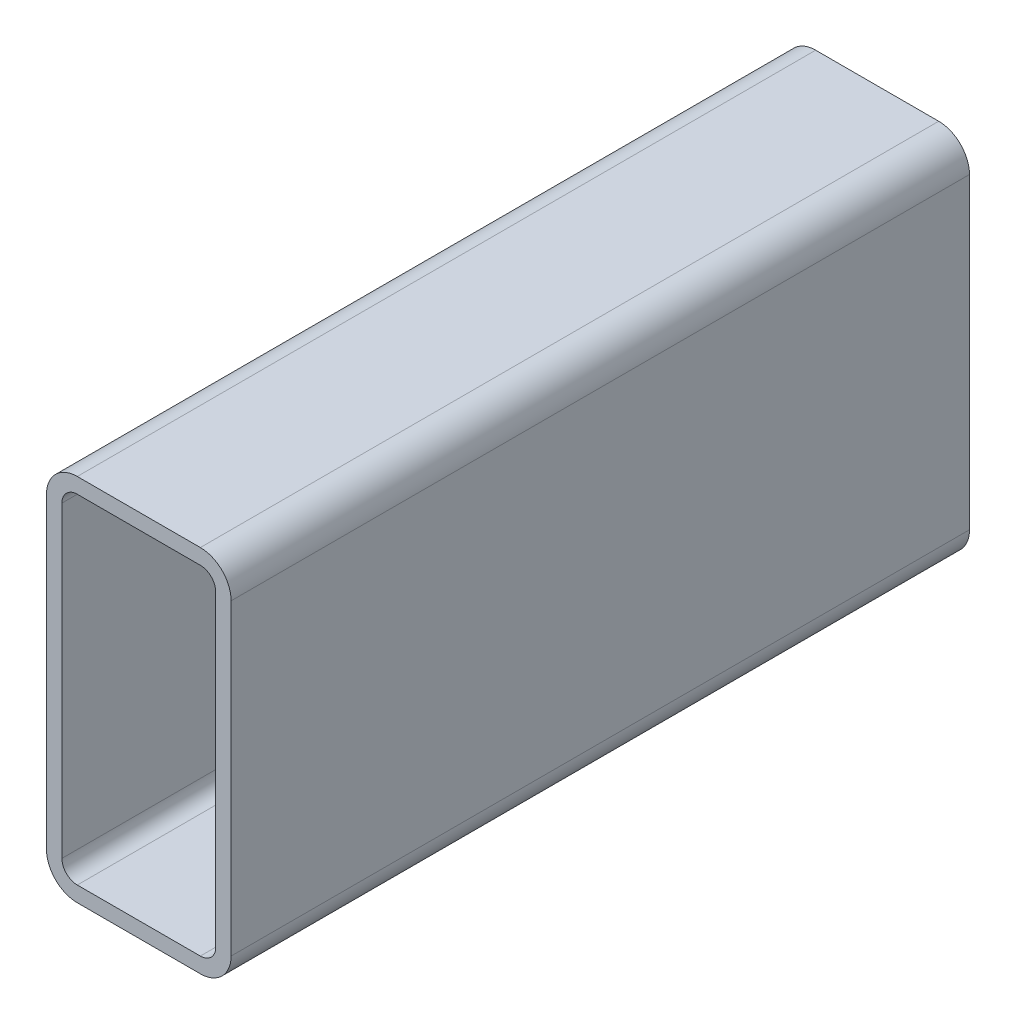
ISO-10303-21;
HEADER;
FILE_DESCRIPTION(('STEP AP214'),'2;1');
FILE_NAME('part.step','',(''),(''),'','','');
FILE_SCHEMA(('AUTOMOTIVE_DESIGN { 1 0 10303 214 1 1 1 1 }'));
ENDSEC;
DATA;
#1=APPLICATION_CONTEXT('core data for automotive mechanical design processes');
#2=APPLICATION_PROTOCOL_DEFINITION('international standard','automotive_design',2000,#1);
#3=PRODUCT_CONTEXT('',#1,'mechanical');
#4=PRODUCT('Part','Part','',(#3));
#5=PRODUCT_RELATED_PRODUCT_CATEGORY('part','',(#4));
#6=PRODUCT_DEFINITION_FORMATION('','',#4);
#7=PRODUCT_DEFINITION_CONTEXT('part definition',#1,'design');
#8=PRODUCT_DEFINITION('design','',#6,#7);
#9=PRODUCT_DEFINITION_SHAPE('','',#8);
#10=(LENGTH_UNIT() NAMED_UNIT(*) SI_UNIT(.MILLI.,.METRE.));
#11=(NAMED_UNIT(*) PLANE_ANGLE_UNIT() SI_UNIT($,.RADIAN.));
#12=(NAMED_UNIT(*) SI_UNIT($,.STERADIAN.) SOLID_ANGLE_UNIT());
#13=UNCERTAINTY_MEASURE_WITH_UNIT(LENGTH_MEASURE(1.E-05),#10,'distance_accuracy_value','');
#14=(GEOMETRIC_REPRESENTATION_CONTEXT(3) GLOBAL_UNCERTAINTY_ASSIGNED_CONTEXT((#13)) GLOBAL_UNIT_ASSIGNED_CONTEXT((#10,
#11,#12)) REPRESENTATION_CONTEXT('',''));
#15=CARTESIAN_POINT('',(0.,0.,0.));
#16=DIRECTION('',(0.,0.,1.));
#17=DIRECTION('',(1.,0.,0.));
#18=AXIS2_PLACEMENT_3D('',#15,#16,#17);
#19=CARTESIAN_POINT('',(15.1891160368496,141.711948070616,304.8));
#20=DIRECTION('',(0.,0.,1.));
#21=DIRECTION('',(1.,0.,0.));
#22=AXIS2_PLACEMENT_3D('',#19,#20,#21);
#23=PLANE('',#22);
#24=CARTESIAN_POINT('',(15.1891160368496,141.711948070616,304.8));
#25=DIRECTION('',(0.,0.,1.));
#26=DIRECTION('',(1.,0.,0.));
#27=AXIS2_PLACEMENT_3D('',#24,#25,#26);
#28=CIRCLE('',#27,12.7);
#29=CARTESIAN_POINT('',(15.1891160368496,154.411948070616,304.8));
#30=VERTEX_POINT('',#29);
#31=CARTESIAN_POINT('',(2.48911603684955,141.711948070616,304.8));
#32=VERTEX_POINT('',#31);
#33=EDGE_CURVE('E211',#30,#32,#28,.T.);
#34=ORIENTED_EDGE('',*,*,#33,.T.);
#35=DIRECTION('',(0.,-1.,0.));
#36=VECTOR('',#35,1.);
#37=CARTESIAN_POINT('',(2.48911603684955,14.7119480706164,304.8));
#38=LINE('',#37,#36);
#39=CARTESIAN_POINT('',(2.48911603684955,14.7119480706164,304.8));
#40=VERTEX_POINT('',#39);
#41=EDGE_CURVE('E214',#32,#40,#38,.T.);
#42=ORIENTED_EDGE('',*,*,#41,.T.);
#43=CARTESIAN_POINT('',(15.1891160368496,14.7119480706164,304.8));
#44=DIRECTION('',(0.,0.,1.));
#45=DIRECTION('',(1.,0.,0.));
#46=AXIS2_PLACEMENT_3D('',#43,#44,#45);
#47=CIRCLE('',#46,12.7);
#48=CARTESIAN_POINT('',(15.1891160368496,2.01194807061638,304.8));
#49=VERTEX_POINT('',#48);
#50=EDGE_CURVE('E217',#40,#49,#47,.T.);
#51=ORIENTED_EDGE('',*,*,#50,.T.);
#52=DIRECTION('',(1.,0.,0.));
#53=VECTOR('',#52,1.);
#54=CARTESIAN_POINT('',(65.9891160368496,2.01194807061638,304.8));
#55=LINE('',#54,#53);
#56=CARTESIAN_POINT('',(65.9891160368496,2.01194807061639,304.8));
#57=VERTEX_POINT('',#56);
#58=EDGE_CURVE('E219',#49,#57,#55,.T.);
#59=ORIENTED_EDGE('',*,*,#58,.T.);
#60=CARTESIAN_POINT('',(65.9891160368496,14.7119480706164,304.8));
#61=DIRECTION('',(0.,0.,1.));
#62=DIRECTION('',(1.,0.,0.));
#63=AXIS2_PLACEMENT_3D('',#60,#61,#62);
#64=CIRCLE('',#63,12.7);
#65=CARTESIAN_POINT('',(78.6891160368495,14.7119480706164,304.8));
#66=VERTEX_POINT('',#65);
#67=EDGE_CURVE('E221',#57,#66,#64,.T.);
#68=ORIENTED_EDGE('',*,*,#67,.T.);
#69=DIRECTION('',(0.,1.,0.));
#70=VECTOR('',#69,1.);
#71=CARTESIAN_POINT('',(78.6891160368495,141.711948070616,304.8));
#72=LINE('',#71,#70);
#73=CARTESIAN_POINT('',(78.6891160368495,141.711948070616,304.8));
#74=VERTEX_POINT('',#73);
#75=EDGE_CURVE('E223',#66,#74,#72,.T.);
#76=ORIENTED_EDGE('',*,*,#75,.T.);
#77=CARTESIAN_POINT('',(65.9891160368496,141.711948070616,304.8));
#78=DIRECTION('',(0.,0.,1.));
#79=DIRECTION('',(1.,0.,0.));
#80=AXIS2_PLACEMENT_3D('',#77,#78,#79);
#81=CIRCLE('',#80,12.7);
#82=CARTESIAN_POINT('',(65.9891160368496,154.411948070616,304.8));
#83=VERTEX_POINT('',#82);
#84=EDGE_CURVE('E225',#74,#83,#81,.T.);
#85=ORIENTED_EDGE('',*,*,#84,.T.);
#86=DIRECTION('',(-1.,0.,0.));
#87=VECTOR('',#86,1.);
#88=CARTESIAN_POINT('',(15.1891160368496,154.411948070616,304.8));
#89=LINE('',#88,#87);
#90=EDGE_CURVE('E227',#83,#30,#89,.T.);
#91=ORIENTED_EDGE('',*,*,#90,.T.);
#92=EDGE_LOOP('',(#34,#42,#51,#59,#68,#76,#85,#91));
#93=FACE_BOUND('',#92,.T.);
#94=DIRECTION('',(0.,-1.,0.));
#95=VECTOR('',#94,1.);
#96=CARTESIAN_POINT('',(8.83911603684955,14.7119480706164,304.8));
#97=LINE('',#96,#95);
#98=CARTESIAN_POINT('',(8.83911603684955,141.711948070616,304.8));
#99=VERTEX_POINT('',#98);
#100=CARTESIAN_POINT('',(8.83911603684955,14.7119480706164,304.8));
#101=VERTEX_POINT('',#100);
#102=EDGE_CURVE('E154',#99,#101,#97,.T.);
#103=ORIENTED_EDGE('',*,*,#102,.F.);
#104=CARTESIAN_POINT('',(15.1891160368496,141.711948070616,304.8));
#105=DIRECTION('',(0.,0.,1.));
#106=DIRECTION('',(1.,0.,0.));
#107=AXIS2_PLACEMENT_3D('',#104,#105,#106);
#108=CIRCLE('',#107,6.35);
#109=CARTESIAN_POINT('',(15.1891160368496,148.061948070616,304.8));
#110=VERTEX_POINT('',#109);
#111=EDGE_CURVE('E146',#110,#99,#108,.T.);
#112=ORIENTED_EDGE('',*,*,#111,.F.);
#113=DIRECTION('',(-1.,0.,0.));
#114=VECTOR('',#113,1.);
#115=CARTESIAN_POINT('',(15.1891160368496,148.061948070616,304.8));
#116=LINE('',#115,#114);
#117=CARTESIAN_POINT('',(65.9891160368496,148.061948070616,304.8));
#118=VERTEX_POINT('',#117);
#119=EDGE_CURVE('E179',#118,#110,#116,.T.);
#120=ORIENTED_EDGE('',*,*,#119,.F.);
#121=CARTESIAN_POINT('',(65.9891160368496,141.711948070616,304.8));
#122=DIRECTION('',(0.,0.,1.));
#123=DIRECTION('',(1.,0.,0.));
#124=AXIS2_PLACEMENT_3D('',#121,#122,#123);
#125=CIRCLE('',#124,6.34999999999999);
#126=CARTESIAN_POINT('',(72.3391160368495,141.711948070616,304.8));
#127=VERTEX_POINT('',#126);
#128=EDGE_CURVE('E177',#127,#118,#125,.T.);
#129=ORIENTED_EDGE('',*,*,#128,.F.);
#130=DIRECTION('',(0.,1.,0.));
#131=VECTOR('',#130,1.);
#132=CARTESIAN_POINT('',(72.3391160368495,141.711948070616,304.8));
#133=LINE('',#132,#131);
#134=CARTESIAN_POINT('',(72.3391160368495,14.7119480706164,304.8));
#135=VERTEX_POINT('',#134);
#136=EDGE_CURVE('E175',#135,#127,#133,.T.);
#137=ORIENTED_EDGE('',*,*,#136,.F.);
#138=CARTESIAN_POINT('',(65.9891160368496,14.7119480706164,304.8));
#139=DIRECTION('',(0.,0.,1.));
#140=DIRECTION('',(1.,0.,0.));
#141=AXIS2_PLACEMENT_3D('',#138,#139,#140);
#142=CIRCLE('',#141,6.35);
#143=CARTESIAN_POINT('',(65.9891160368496,8.36194807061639,304.8));
#144=VERTEX_POINT('',#143);
#145=EDGE_CURVE('E173',#144,#135,#142,.T.);
#146=ORIENTED_EDGE('',*,*,#145,.F.);
#147=DIRECTION('',(1.,0.,0.));
#148=VECTOR('',#147,1.);
#149=CARTESIAN_POINT('',(65.9891160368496,8.36194807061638,304.8));
#150=LINE('',#149,#148);
#151=CARTESIAN_POINT('',(15.1891160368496,8.36194807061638,304.8));
#152=VERTEX_POINT('',#151);
#153=EDGE_CURVE('E169',#152,#144,#150,.T.);
#154=ORIENTED_EDGE('',*,*,#153,.F.);
#155=CARTESIAN_POINT('',(15.1891160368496,14.7119480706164,304.8));
#156=DIRECTION('',(0.,0.,1.));
#157=DIRECTION('',(1.,0.,0.));
#158=AXIS2_PLACEMENT_3D('',#155,#156,#157);
#159=CIRCLE('',#158,6.35);
#160=EDGE_CURVE('E167',#101,#152,#159,.T.);
#161=ORIENTED_EDGE('',*,*,#160,.F.);
#162=EDGE_LOOP('',(#103,#112,#120,#129,#137,#146,#154,#161));
#163=FACE_BOUND('',#162,.T.);
#164=ADVANCED_FACE('F33',(#93,#163),#23,.T.);
#165=CARTESIAN_POINT('',(15.1891160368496,141.711948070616,0.));
#166=DIRECTION('',(0.,0.,1.));
#167=DIRECTION('',(1.,0.,0.));
#168=AXIS2_PLACEMENT_3D('',#165,#166,#167);
#169=PLANE('',#168);
#170=CARTESIAN_POINT('',(15.1891160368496,141.711948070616,0.));
#171=DIRECTION('',(0.,0.,1.));
#172=DIRECTION('',(1.,0.,0.));
#173=AXIS2_PLACEMENT_3D('',#170,#171,#172);
#174=CIRCLE('',#173,12.7);
#175=CARTESIAN_POINT('',(15.1891160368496,154.411948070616,0.));
#176=VERTEX_POINT('',#175);
#177=CARTESIAN_POINT('',(2.48911603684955,141.711948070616,0.));
#178=VERTEX_POINT('',#177);
#179=EDGE_CURVE('E162',#176,#178,#174,.T.);
#180=ORIENTED_EDGE('',*,*,#179,.F.);
#181=DIRECTION('',(-1.,0.,0.));
#182=VECTOR('',#181,1.);
#183=CARTESIAN_POINT('',(15.1891160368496,154.411948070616,0.));
#184=LINE('',#183,#182);
#185=CARTESIAN_POINT('',(65.9891160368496,154.411948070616,0.));
#186=VERTEX_POINT('',#185);
#187=EDGE_CURVE('E215',#186,#176,#184,.T.);
#188=ORIENTED_EDGE('',*,*,#187,.F.);
#189=CARTESIAN_POINT('',(65.9891160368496,141.711948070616,0.));
#190=DIRECTION('',(0.,0.,1.));
#191=DIRECTION('',(1.,0.,0.));
#192=AXIS2_PLACEMENT_3D('',#189,#190,#191);
#193=CIRCLE('',#192,12.7);
#194=CARTESIAN_POINT('',(78.6891160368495,141.711948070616,0.));
#195=VERTEX_POINT('',#194);
#196=EDGE_CURVE('E242',#195,#186,#193,.T.);
#197=ORIENTED_EDGE('',*,*,#196,.F.);
#198=DIRECTION('',(0.,1.,0.));
#199=VECTOR('',#198,1.);
#200=CARTESIAN_POINT('',(78.6891160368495,141.711948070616,0.));
#201=LINE('',#200,#199);
#202=CARTESIAN_POINT('',(78.6891160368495,14.7119480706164,0.));
#203=VERTEX_POINT('',#202);
#204=EDGE_CURVE('E240',#203,#195,#201,.T.);
#205=ORIENTED_EDGE('',*,*,#204,.F.);
#206=CARTESIAN_POINT('',(65.9891160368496,14.7119480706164,0.));
#207=DIRECTION('',(0.,0.,1.));
#208=DIRECTION('',(1.,0.,0.));
#209=AXIS2_PLACEMENT_3D('',#206,#207,#208);
#210=CIRCLE('',#209,12.7);
#211=CARTESIAN_POINT('',(65.9891160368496,2.01194807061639,0.));
#212=VERTEX_POINT('',#211);
#213=EDGE_CURVE('E238',#212,#203,#210,.T.);
#214=ORIENTED_EDGE('',*,*,#213,.F.);
#215=DIRECTION('',(1.,0.,0.));
#216=VECTOR('',#215,1.);
#217=CARTESIAN_POINT('',(65.9891160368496,2.01194807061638,0.));
#218=LINE('',#217,#216);
#219=CARTESIAN_POINT('',(15.1891160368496,2.01194807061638,0.));
#220=VERTEX_POINT('',#219);
#221=EDGE_CURVE('E236',#220,#212,#218,.T.);
#222=ORIENTED_EDGE('',*,*,#221,.F.);
#223=CARTESIAN_POINT('',(15.1891160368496,14.7119480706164,0.));
#224=DIRECTION('',(0.,0.,1.));
#225=DIRECTION('',(1.,0.,0.));
#226=AXIS2_PLACEMENT_3D('',#223,#224,#225);
#227=CIRCLE('',#226,12.7);
#228=CARTESIAN_POINT('',(2.48911603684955,14.7119480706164,0.));
#229=VERTEX_POINT('',#228);
#230=EDGE_CURVE('E234',#229,#220,#227,.T.);
#231=ORIENTED_EDGE('',*,*,#230,.F.);
#232=DIRECTION('',(0.,-1.,0.));
#233=VECTOR('',#232,1.);
#234=CARTESIAN_POINT('',(2.48911603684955,14.7119480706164,0.));
#235=LINE('',#234,#233);
#236=EDGE_CURVE('E232',#178,#229,#235,.T.);
#237=ORIENTED_EDGE('',*,*,#236,.F.);
#238=EDGE_LOOP('',(#180,#188,#197,#205,#214,#222,#231,#237));
#239=FACE_BOUND('',#238,.T.);
#240=CARTESIAN_POINT('',(15.1891160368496,141.711948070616,0.));
#241=DIRECTION('',(0.,0.,1.));
#242=DIRECTION('',(1.,0.,0.));
#243=AXIS2_PLACEMENT_3D('',#240,#241,#242);
#244=CIRCLE('',#243,6.35);
#245=CARTESIAN_POINT('',(15.1891160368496,148.061948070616,0.));
#246=VERTEX_POINT('',#245);
#247=CARTESIAN_POINT('',(8.83911603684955,141.711948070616,0.));
#248=VERTEX_POINT('',#247);
#249=EDGE_CURVE('E56',#246,#248,#244,.T.);
#250=ORIENTED_EDGE('',*,*,#249,.T.);
#251=DIRECTION('',(0.,-1.,0.));
#252=VECTOR('',#251,1.);
#253=CARTESIAN_POINT('',(8.83911603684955,14.7119480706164,0.));
#254=LINE('',#253,#252);
#255=CARTESIAN_POINT('',(8.83911603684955,14.7119480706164,0.));
#256=VERTEX_POINT('',#255);
#257=EDGE_CURVE('E161',#248,#256,#254,.T.);
#258=ORIENTED_EDGE('',*,*,#257,.T.);
#259=CARTESIAN_POINT('',(15.1891160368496,14.7119480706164,0.));
#260=DIRECTION('',(0.,0.,1.));
#261=DIRECTION('',(1.,0.,0.));
#262=AXIS2_PLACEMENT_3D('',#259,#260,#261);
#263=CIRCLE('',#262,6.35);
#264=CARTESIAN_POINT('',(15.1891160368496,8.36194807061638,0.));
#265=VERTEX_POINT('',#264);
#266=EDGE_CURVE('E183',#256,#265,#263,.T.);
#267=ORIENTED_EDGE('',*,*,#266,.T.);
#268=DIRECTION('',(1.,0.,0.));
#269=VECTOR('',#268,1.);
#270=CARTESIAN_POINT('',(65.9891160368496,8.36194807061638,0.));
#271=LINE('',#270,#269);
#272=CARTESIAN_POINT('',(65.9891160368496,8.36194807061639,0.));
#273=VERTEX_POINT('',#272);
#274=EDGE_CURVE('E186',#265,#273,#271,.T.);
#275=ORIENTED_EDGE('',*,*,#274,.T.);
#276=CARTESIAN_POINT('',(65.9891160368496,14.7119480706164,0.));
#277=DIRECTION('',(0.,0.,1.));
#278=DIRECTION('',(1.,0.,0.));
#279=AXIS2_PLACEMENT_3D('',#276,#277,#278);
#280=CIRCLE('',#279,6.35);
#281=CARTESIAN_POINT('',(72.3391160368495,14.7119480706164,0.));
#282=VERTEX_POINT('',#281);
#283=EDGE_CURVE('E189',#273,#282,#280,.T.);
#284=ORIENTED_EDGE('',*,*,#283,.T.);
#285=DIRECTION('',(0.,1.,0.));
#286=VECTOR('',#285,1.);
#287=CARTESIAN_POINT('',(72.3391160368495,141.711948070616,0.));
#288=LINE('',#287,#286);
#289=CARTESIAN_POINT('',(72.3391160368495,141.711948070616,0.));
#290=VERTEX_POINT('',#289);
#291=EDGE_CURVE('E192',#282,#290,#288,.T.);
#292=ORIENTED_EDGE('',*,*,#291,.T.);
#293=CARTESIAN_POINT('',(65.9891160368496,141.711948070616,0.));
#294=DIRECTION('',(0.,0.,1.));
#295=DIRECTION('',(1.,0.,0.));
#296=AXIS2_PLACEMENT_3D('',#293,#294,#295);
#297=CIRCLE('',#296,6.34999999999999);
#298=CARTESIAN_POINT('',(65.9891160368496,148.061948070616,0.));
#299=VERTEX_POINT('',#298);
#300=EDGE_CURVE('E195',#290,#299,#297,.T.);
#301=ORIENTED_EDGE('',*,*,#300,.T.);
#302=DIRECTION('',(-1.,0.,0.));
#303=VECTOR('',#302,1.);
#304=CARTESIAN_POINT('',(15.1891160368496,148.061948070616,0.));
#305=LINE('',#304,#303);
#306=EDGE_CURVE('E155',#299,#246,#305,.T.);
#307=ORIENTED_EDGE('',*,*,#306,.T.);
#308=EDGE_LOOP('',(#250,#258,#267,#275,#284,#292,#301,#307));
#309=FACE_BOUND('',#308,.T.);
#310=ADVANCED_FACE('F272',(#239,#309),#169,.F.);
#311=CARTESIAN_POINT('',(15.1891160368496,141.711948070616,304.8));
#312=DIRECTION('',(0.,0.,-1.));
#313=DIRECTION('',(-1.,0.,0.));
#314=AXIS2_PLACEMENT_3D('',#311,#312,#313);
#315=CYLINDRICAL_SURFACE('',#314,12.7);
#316=ORIENTED_EDGE('',*,*,#179,.T.);
#317=DIRECTION('',(0.,0.,-1.));
#318=VECTOR('',#317,1.);
#319=CARTESIAN_POINT('',(2.48911603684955,141.711948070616,304.8));
#320=LINE('',#319,#318);
#321=EDGE_CURVE('E11',#32,#178,#320,.T.);
#322=ORIENTED_EDGE('',*,*,#321,.F.);
#323=ORIENTED_EDGE('',*,*,#33,.F.);
#324=DIRECTION('',(0.,0.,-1.));
#325=VECTOR('',#324,1.);
#326=CARTESIAN_POINT('',(15.1891160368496,154.411948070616,304.8));
#327=LINE('',#326,#325);
#328=EDGE_CURVE('E229',#30,#176,#327,.T.);
#329=ORIENTED_EDGE('',*,*,#328,.T.);
#330=EDGE_LOOP('',(#316,#322,#323,#329));
#331=FACE_BOUND('',#330,.T.);
#332=ADVANCED_FACE('F35',(#331),#315,.T.);
#333=CARTESIAN_POINT('',(2.48911603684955,14.7119480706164,304.8));
#334=DIRECTION('',(1.,0.,0.));
#335=DIRECTION('',(0.,0.,-1.));
#336=AXIS2_PLACEMENT_3D('',#333,#334,#335);
#337=PLANE('',#336);
#338=ORIENTED_EDGE('',*,*,#236,.T.);
#339=DIRECTION('',(0.,0.,-1.));
#340=VECTOR('',#339,1.);
#341=CARTESIAN_POINT('',(2.48911603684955,14.7119480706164,304.8));
#342=LINE('',#341,#340);
#343=EDGE_CURVE('E41',#40,#229,#342,.T.);
#344=ORIENTED_EDGE('',*,*,#343,.F.);
#345=ORIENTED_EDGE('',*,*,#41,.F.);
#346=ORIENTED_EDGE('',*,*,#321,.T.);
#347=EDGE_LOOP('',(#338,#344,#345,#346));
#348=FACE_BOUND('',#347,.T.);
#349=ADVANCED_FACE('F289',(#348),#337,.F.);
#350=CARTESIAN_POINT('',(15.1891160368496,14.7119480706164,304.8));
#351=DIRECTION('',(0.,0.,-1.));
#352=DIRECTION('',(-1.,0.,0.));
#353=AXIS2_PLACEMENT_3D('',#350,#351,#352);
#354=CYLINDRICAL_SURFACE('',#353,12.7);
#355=ORIENTED_EDGE('',*,*,#230,.T.);
#356=DIRECTION('',(0.,0.,-1.));
#357=VECTOR('',#356,1.);
#358=CARTESIAN_POINT('',(15.1891160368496,2.01194807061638,304.8));
#359=LINE('',#358,#357);
#360=EDGE_CURVE('E259',#49,#220,#359,.T.);
#361=ORIENTED_EDGE('',*,*,#360,.F.);
#362=ORIENTED_EDGE('',*,*,#50,.F.);
#363=ORIENTED_EDGE('',*,*,#343,.T.);
#364=EDGE_LOOP('',(#355,#361,#362,#363));
#365=FACE_BOUND('',#364,.T.);
#366=ADVANCED_FACE('F266',(#365),#354,.T.);
#367=CARTESIAN_POINT('',(65.9891160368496,2.01194807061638,304.8));
#368=DIRECTION('',(0.,1.,0.));
#369=DIRECTION('',(0.,0.,1.));
#370=AXIS2_PLACEMENT_3D('',#367,#368,#369);
#371=PLANE('',#370);
#372=ORIENTED_EDGE('',*,*,#221,.T.);
#373=DIRECTION('',(0.,0.,-1.));
#374=VECTOR('',#373,1.);
#375=CARTESIAN_POINT('',(65.9891160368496,2.01194807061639,304.8));
#376=LINE('',#375,#374);
#377=EDGE_CURVE('E256',#57,#212,#376,.T.);
#378=ORIENTED_EDGE('',*,*,#377,.F.);
#379=ORIENTED_EDGE('',*,*,#58,.F.);
#380=ORIENTED_EDGE('',*,*,#360,.T.);
#381=EDGE_LOOP('',(#372,#378,#379,#380));
#382=FACE_BOUND('',#381,.T.);
#383=ADVANCED_FACE('F278',(#382),#371,.F.);
#384=CARTESIAN_POINT('',(65.9891160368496,14.7119480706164,304.8));
#385=DIRECTION('',(0.,0.,-1.));
#386=DIRECTION('',(-1.,0.,0.));
#387=AXIS2_PLACEMENT_3D('',#384,#385,#386);
#388=CYLINDRICAL_SURFACE('',#387,12.7);
#389=ORIENTED_EDGE('',*,*,#213,.T.);
#390=DIRECTION('',(0.,0.,-1.));
#391=VECTOR('',#390,1.);
#392=CARTESIAN_POINT('',(78.6891160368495,14.7119480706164,304.8));
#393=LINE('',#392,#391);
#394=EDGE_CURVE('E253',#66,#203,#393,.T.);
#395=ORIENTED_EDGE('',*,*,#394,.F.);
#396=ORIENTED_EDGE('',*,*,#67,.F.);
#397=ORIENTED_EDGE('',*,*,#377,.T.);
#398=EDGE_LOOP('',(#389,#395,#396,#397));
#399=FACE_BOUND('',#398,.T.);
#400=ADVANCED_FACE('F282',(#399),#388,.T.);
#401=CARTESIAN_POINT('',(78.6891160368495,141.711948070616,304.8));
#402=DIRECTION('',(-1.,0.,0.));
#403=DIRECTION('',(0.,0.,1.));
#404=AXIS2_PLACEMENT_3D('',#401,#402,#403);
#405=PLANE('',#404);
#406=ORIENTED_EDGE('',*,*,#204,.T.);
#407=DIRECTION('',(0.,0.,-1.));
#408=VECTOR('',#407,1.);
#409=CARTESIAN_POINT('',(78.6891160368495,141.711948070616,304.8));
#410=LINE('',#409,#408);
#411=EDGE_CURVE('E250',#74,#195,#410,.T.);
#412=ORIENTED_EDGE('',*,*,#411,.F.);
#413=ORIENTED_EDGE('',*,*,#75,.F.);
#414=ORIENTED_EDGE('',*,*,#394,.T.);
#415=EDGE_LOOP('',(#406,#412,#413,#414));
#416=FACE_BOUND('',#415,.T.);
#417=ADVANCED_FACE('F302',(#416),#405,.F.);
#418=CARTESIAN_POINT('',(65.9891160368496,141.711948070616,304.8));
#419=DIRECTION('',(0.,0.,-1.));
#420=DIRECTION('',(-1.,0.,0.));
#421=AXIS2_PLACEMENT_3D('',#418,#419,#420);
#422=CYLINDRICAL_SURFACE('',#421,12.7);
#423=ORIENTED_EDGE('',*,*,#196,.T.);
#424=DIRECTION('',(0.,0.,-1.));
#425=VECTOR('',#424,1.);
#426=CARTESIAN_POINT('',(65.9891160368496,154.411948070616,304.8));
#427=LINE('',#426,#425);
#428=EDGE_CURVE('E247',#83,#186,#427,.T.);
#429=ORIENTED_EDGE('',*,*,#428,.F.);
#430=ORIENTED_EDGE('',*,*,#84,.F.);
#431=ORIENTED_EDGE('',*,*,#411,.T.);
#432=EDGE_LOOP('',(#423,#429,#430,#431));
#433=FACE_BOUND('',#432,.T.);
#434=ADVANCED_FACE('F300',(#433),#422,.T.);
#435=CARTESIAN_POINT('',(15.1891160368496,154.411948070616,304.8));
#436=DIRECTION('',(0.,-1.,0.));
#437=DIRECTION('',(0.,0.,-1.));
#438=AXIS2_PLACEMENT_3D('',#435,#436,#437);
#439=PLANE('',#438);
#440=ORIENTED_EDGE('',*,*,#187,.T.);
#441=ORIENTED_EDGE('',*,*,#328,.F.);
#442=ORIENTED_EDGE('',*,*,#90,.F.);
#443=ORIENTED_EDGE('',*,*,#428,.T.);
#444=EDGE_LOOP('',(#440,#441,#442,#443));
#445=FACE_BOUND('',#444,.T.);
#446=ADVANCED_FACE('F295',(#445),#439,.F.);
#447=CARTESIAN_POINT('',(15.1891160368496,141.711948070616,304.8));
#448=DIRECTION('',(0.,0.,-1.));
#449=DIRECTION('',(-1.,0.,0.));
#450=AXIS2_PLACEMENT_3D('',#447,#448,#449);
#451=CYLINDRICAL_SURFACE('',#450,6.35);
#452=ORIENTED_EDGE('',*,*,#249,.F.);
#453=DIRECTION('',(0.,0.,-1.));
#454=VECTOR('',#453,1.);
#455=CARTESIAN_POINT('',(15.1891160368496,148.061948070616,304.8));
#456=LINE('',#455,#454);
#457=EDGE_CURVE('E150',#110,#246,#456,.T.);
#458=ORIENTED_EDGE('',*,*,#457,.F.);
#459=ORIENTED_EDGE('',*,*,#111,.T.);
#460=DIRECTION('',(0.,0.,-1.));
#461=VECTOR('',#460,1.);
#462=CARTESIAN_POINT('',(8.83911603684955,141.711948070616,304.8));
#463=LINE('',#462,#461);
#464=EDGE_CURVE('E149',#99,#248,#463,.T.);
#465=ORIENTED_EDGE('',*,*,#464,.T.);
#466=EDGE_LOOP('',(#452,#458,#459,#465));
#467=FACE_BOUND('',#466,.T.);
#468=ADVANCED_FACE('F148',(#467),#451,.F.);
#469=CARTESIAN_POINT('',(8.83911603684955,14.7119480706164,304.8));
#470=DIRECTION('',(1.,0.,0.));
#471=DIRECTION('',(0.,0.,-1.));
#472=AXIS2_PLACEMENT_3D('',#469,#470,#471);
#473=PLANE('',#472);
#474=ORIENTED_EDGE('',*,*,#257,.F.);
#475=ORIENTED_EDGE('',*,*,#464,.F.);
#476=ORIENTED_EDGE('',*,*,#102,.T.);
#477=DIRECTION('',(0.,0.,-1.));
#478=VECTOR('',#477,1.);
#479=CARTESIAN_POINT('',(8.83911603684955,14.7119480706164,304.8));
#480=LINE('',#479,#478);
#481=EDGE_CURVE('E163',#101,#256,#480,.T.);
#482=ORIENTED_EDGE('',*,*,#481,.T.);
#483=EDGE_LOOP('',(#474,#475,#476,#482));
#484=FACE_BOUND('',#483,.T.);
#485=ADVANCED_FACE('F158',(#484),#473,.T.);
#486=CARTESIAN_POINT('',(15.1891160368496,14.7119480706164,304.8));
#487=DIRECTION('',(0.,0.,-1.));
#488=DIRECTION('',(-1.,0.,0.));
#489=AXIS2_PLACEMENT_3D('',#486,#487,#488);
#490=CYLINDRICAL_SURFACE('',#489,6.35);
#491=ORIENTED_EDGE('',*,*,#266,.F.);
#492=ORIENTED_EDGE('',*,*,#481,.F.);
#493=ORIENTED_EDGE('',*,*,#160,.T.);
#494=DIRECTION('',(0.,0.,-1.));
#495=VECTOR('',#494,1.);
#496=CARTESIAN_POINT('',(15.1891160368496,8.36194807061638,304.8));
#497=LINE('',#496,#495);
#498=EDGE_CURVE('E208',#152,#265,#497,.T.);
#499=ORIENTED_EDGE('',*,*,#498,.T.);
#500=EDGE_LOOP('',(#491,#492,#493,#499));
#501=FACE_BOUND('',#500,.T.);
#502=ADVANCED_FACE('F327',(#501),#490,.F.);
#503=CARTESIAN_POINT('',(65.9891160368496,8.36194807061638,304.8));
#504=DIRECTION('',(0.,1.,0.));
#505=DIRECTION('',(0.,0.,1.));
#506=AXIS2_PLACEMENT_3D('',#503,#504,#505);
#507=PLANE('',#506);
#508=ORIENTED_EDGE('',*,*,#274,.F.);
#509=ORIENTED_EDGE('',*,*,#498,.F.);
#510=ORIENTED_EDGE('',*,*,#153,.T.);
#511=DIRECTION('',(0.,0.,-1.));
#512=VECTOR('',#511,1.);
#513=CARTESIAN_POINT('',(65.9891160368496,8.36194807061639,304.8));
#514=LINE('',#513,#512);
#515=EDGE_CURVE('E206',#144,#273,#514,.T.);
#516=ORIENTED_EDGE('',*,*,#515,.T.);
#517=EDGE_LOOP('',(#508,#509,#510,#516));
#518=FACE_BOUND('',#517,.T.);
#519=ADVANCED_FACE('F331',(#518),#507,.T.);
#520=CARTESIAN_POINT('',(65.9891160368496,14.7119480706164,304.8));
#521=DIRECTION('',(0.,0.,-1.));
#522=DIRECTION('',(-1.,0.,0.));
#523=AXIS2_PLACEMENT_3D('',#520,#521,#522);
#524=CYLINDRICAL_SURFACE('',#523,6.35);
#525=ORIENTED_EDGE('',*,*,#283,.F.);
#526=ORIENTED_EDGE('',*,*,#515,.F.);
#527=ORIENTED_EDGE('',*,*,#145,.T.);
#528=DIRECTION('',(0.,0.,-1.));
#529=VECTOR('',#528,1.);
#530=CARTESIAN_POINT('',(72.3391160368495,14.7119480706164,304.8));
#531=LINE('',#530,#529);
#532=EDGE_CURVE('E204',#135,#282,#531,.T.);
#533=ORIENTED_EDGE('',*,*,#532,.T.);
#534=EDGE_LOOP('',(#525,#526,#527,#533));
#535=FACE_BOUND('',#534,.T.);
#536=ADVANCED_FACE('F337',(#535),#524,.F.);
#537=CARTESIAN_POINT('',(72.3391160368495,141.711948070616,304.8));
#538=DIRECTION('',(-1.,0.,0.));
#539=DIRECTION('',(0.,0.,1.));
#540=AXIS2_PLACEMENT_3D('',#537,#538,#539);
#541=PLANE('',#540);
#542=ORIENTED_EDGE('',*,*,#291,.F.);
#543=ORIENTED_EDGE('',*,*,#532,.F.);
#544=ORIENTED_EDGE('',*,*,#136,.T.);
#545=DIRECTION('',(0.,0.,-1.));
#546=VECTOR('',#545,1.);
#547=CARTESIAN_POINT('',(72.3391160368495,141.711948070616,304.8));
#548=LINE('',#547,#546);
#549=EDGE_CURVE('E202',#127,#290,#548,.T.);
#550=ORIENTED_EDGE('',*,*,#549,.T.);
#551=EDGE_LOOP('',(#542,#543,#544,#550));
#552=FACE_BOUND('',#551,.T.);
#553=ADVANCED_FACE('F341',(#552),#541,.T.);
#554=CARTESIAN_POINT('',(65.9891160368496,141.711948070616,304.8));
#555=DIRECTION('',(0.,0.,-1.));
#556=DIRECTION('',(-1.,0.,0.));
#557=AXIS2_PLACEMENT_3D('',#554,#555,#556);
#558=CYLINDRICAL_SURFACE('',#557,6.34999999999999);
#559=ORIENTED_EDGE('',*,*,#300,.F.);
#560=ORIENTED_EDGE('',*,*,#549,.F.);
#561=ORIENTED_EDGE('',*,*,#128,.T.);
#562=DIRECTION('',(0.,0.,-1.));
#563=VECTOR('',#562,1.);
#564=CARTESIAN_POINT('',(65.9891160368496,148.061948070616,304.8));
#565=LINE('',#564,#563);
#566=EDGE_CURVE('E48',#118,#299,#565,.T.);
#567=ORIENTED_EDGE('',*,*,#566,.T.);
#568=EDGE_LOOP('',(#559,#560,#561,#567));
#569=FACE_BOUND('',#568,.T.);
#570=ADVANCED_FACE('F345',(#569),#558,.F.);
#571=CARTESIAN_POINT('',(15.1891160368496,148.061948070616,304.8));
#572=DIRECTION('',(0.,-1.,0.));
#573=DIRECTION('',(0.,0.,-1.));
#574=AXIS2_PLACEMENT_3D('',#571,#572,#573);
#575=PLANE('',#574);
#576=ORIENTED_EDGE('',*,*,#306,.F.);
#577=ORIENTED_EDGE('',*,*,#566,.F.);
#578=ORIENTED_EDGE('',*,*,#119,.T.);
#579=ORIENTED_EDGE('',*,*,#457,.T.);
#580=EDGE_LOOP('',(#576,#577,#578,#579));
#581=FACE_BOUND('',#580,.T.);
#582=ADVANCED_FACE('F349',(#581),#575,.T.);
#583=CLOSED_SHELL('',(#164,#310,#332,#349,#366,#383,#400,#417,#434,#446,#468,#485,#502,#519,
#536,#553,#570,#582));
#584=MANIFOLD_SOLID_BREP('B2',#583);
#585=ADVANCED_BREP_SHAPE_REPRESENTATION('',(#18,#584),#14);
#586=SHAPE_DEFINITION_REPRESENTATION(#9,#585);
ENDSEC;
END-ISO-10303-21;
